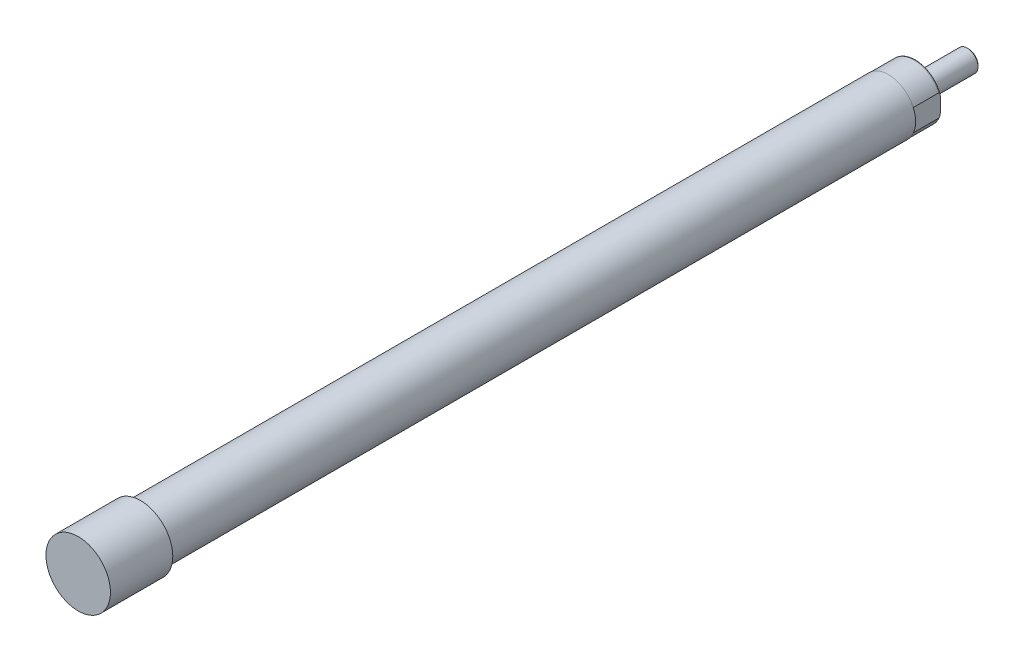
ISO-10303-21;
HEADER;
FILE_DESCRIPTION(('STEP AP214'),'2;1');
FILE_NAME('part.step','',(''),(''),'','','');
FILE_SCHEMA(('AUTOMOTIVE_DESIGN { 1 0 10303 214 1 1 1 1 }'));
ENDSEC;
DATA;
#1=APPLICATION_CONTEXT('core data for automotive mechanical design processes');
#2=APPLICATION_PROTOCOL_DEFINITION('international standard','automotive_design',2000,#1);
#3=PRODUCT_CONTEXT('',#1,'mechanical');
#4=PRODUCT('Part','Part','',(#3));
#5=PRODUCT_RELATED_PRODUCT_CATEGORY('part','',(#4));
#6=PRODUCT_DEFINITION_FORMATION('','',#4);
#7=PRODUCT_DEFINITION_CONTEXT('part definition',#1,'design');
#8=PRODUCT_DEFINITION('design','',#6,#7);
#9=PRODUCT_DEFINITION_SHAPE('','',#8);
#10=(LENGTH_UNIT() NAMED_UNIT(*) SI_UNIT(.MILLI.,.METRE.));
#11=(NAMED_UNIT(*) PLANE_ANGLE_UNIT() SI_UNIT($,.RADIAN.));
#12=(NAMED_UNIT(*) SI_UNIT($,.STERADIAN.) SOLID_ANGLE_UNIT());
#13=UNCERTAINTY_MEASURE_WITH_UNIT(LENGTH_MEASURE(1.E-05),#10,'distance_accuracy_value','');
#14=(GEOMETRIC_REPRESENTATION_CONTEXT(3) GLOBAL_UNCERTAINTY_ASSIGNED_CONTEXT((#13)) GLOBAL_UNIT_ASSIGNED_CONTEXT((#10,
#11,#12)) REPRESENTATION_CONTEXT('',''));
#15=CARTESIAN_POINT('',(0.,0.,0.));
#16=DIRECTION('',(0.,0.,1.));
#17=DIRECTION('',(1.,0.,0.));
#18=AXIS2_PLACEMENT_3D('',#15,#16,#17);
#19=CARTESIAN_POINT('',(0.,0.,389.514986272));
#20=DIRECTION('',(0.,0.,1.));
#21=DIRECTION('',(1.,0.,0.));
#22=AXIS2_PLACEMENT_3D('',#19,#20,#21);
#23=PLANE('',#22);
#24=CARTESIAN_POINT('',(0.,0.,389.514986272));
#25=DIRECTION('',(0.,0.,1.));
#26=DIRECTION('',(1.,0.,0.));
#27=AXIS2_PLACEMENT_3D('',#24,#25,#26);
#28=CIRCLE('',#27,15.);
#29=CARTESIAN_POINT('',(15.,0.,389.514986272));
#30=VERTEX_POINT('',#29);
#31=EDGE_CURVE('E201',#30,#30,#28,.T.);
#32=ORIENTED_EDGE('',*,*,#31,.T.);
#33=EDGE_LOOP('',(#32));
#34=FACE_BOUND('',#33,.T.);
#35=ADVANCED_FACE('F16',(#34),#23,.T.);
#36=CARTESIAN_POINT('',(0.,0.,389.514986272));
#37=DIRECTION('',(0.,0.,-1.));
#38=DIRECTION('',(-1.,0.,0.));
#39=AXIS2_PLACEMENT_3D('',#36,#37,#38);
#40=CYLINDRICAL_SURFACE('',#39,15.);
#41=ORIENTED_EDGE('',*,*,#31,.F.);
#42=EDGE_LOOP('',(#41));
#43=FACE_BOUND('',#42,.T.);
#44=CARTESIAN_POINT('',(0.,0.,360.514486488));
#45=DIRECTION('',(0.,0.,1.));
#46=DIRECTION('',(1.,0.,0.));
#47=AXIS2_PLACEMENT_3D('',#44,#45,#46);
#48=CIRCLE('',#47,15.);
#49=CARTESIAN_POINT('',(15.,0.,360.514486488));
#50=VERTEX_POINT('',#49);
#51=EDGE_CURVE('E199',#50,#50,#48,.T.);
#52=ORIENTED_EDGE('',*,*,#51,.T.);
#53=EDGE_LOOP('',(#52));
#54=FACE_BOUND('',#53,.T.);
#55=ADVANCED_FACE('F176',(#43,#54),#40,.T.);
#56=CARTESIAN_POINT('',(0.,0.,360.514486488));
#57=DIRECTION('',(0.,0.,1.));
#58=DIRECTION('',(1.,0.,0.));
#59=AXIS2_PLACEMENT_3D('',#56,#57,#58);
#60=PLANE('',#59);
#61=CARTESIAN_POINT('',(0.,0.,360.514486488));
#62=DIRECTION('',(0.,0.,1.));
#63=DIRECTION('',(1.,0.,0.));
#64=AXIS2_PLACEMENT_3D('',#61,#62,#63);
#65=CIRCLE('',#64,12.573);
#66=CARTESIAN_POINT('',(12.573,0.,360.514486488));
#67=VERTEX_POINT('',#66);
#68=EDGE_CURVE('E20',#67,#67,#65,.T.);
#69=ORIENTED_EDGE('',*,*,#68,.T.);
#70=EDGE_LOOP('',(#69));
#71=FACE_BOUND('',#70,.T.);
#72=ORIENTED_EDGE('',*,*,#51,.F.);
#73=EDGE_LOOP('',(#72));
#74=FACE_BOUND('',#73,.T.);
#75=ADVANCED_FACE('F183',(#71,#74),#60,.F.);
#76=CARTESIAN_POINT('',(0.,0.,360.210395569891));
#77=DIRECTION('',(0.,0.,1.));
#78=DIRECTION('',(1.,0.,0.));
#79=AXIS2_PLACEMENT_3D('',#76,#77,#78);
#80=CYLINDRICAL_SURFACE('',#79,12.573);
#81=ORIENTED_EDGE('',*,*,#68,.F.);
#82=EDGE_LOOP('',(#81));
#83=FACE_BOUND('',#82,.T.);
#84=CARTESIAN_POINT('',(0.,0.,360.00698636));
#85=DIRECTION('',(0.,0.,1.));
#86=DIRECTION('',(0.,-1.,0.));
#87=AXIS2_PLACEMENT_3D('',#84,#85,#86);
#88=CIRCLE('',#87,12.573);
#89=CARTESIAN_POINT('',(0.,-12.573,360.00698636));
#90=VERTEX_POINT('',#89);
#91=EDGE_CURVE('E208',#90,#90,#88,.F.);
#92=ORIENTED_EDGE('',*,*,#91,.F.);
#93=EDGE_LOOP('',(#92));
#94=FACE_BOUND('',#93,.T.);
#95=ADVANCED_FACE('F18',(#83,#94),#80,.T.);
#96=CARTESIAN_POINT('',(0.,0.,360.00698636));
#97=DIRECTION('',(0.,0.,1.));
#98=DIRECTION('',(-1.,0.,0.));
#99=AXIS2_PLACEMENT_3D('',#96,#97,#98);
#100=PLANE('',#99);
#101=ORIENTED_EDGE('',*,*,#91,.T.);
#102=EDGE_LOOP('',(#101));
#103=FACE_BOUND('',#102,.T.);
#104=CARTESIAN_POINT('',(0.,0.,360.00698636));
#105=DIRECTION('',(0.,0.,1.));
#106=DIRECTION('',(-1.,0.,0.));
#107=AXIS2_PLACEMENT_3D('',#104,#105,#106);
#108=CIRCLE('',#107,12.69238);
#109=CARTESIAN_POINT('',(-12.69238,0.,360.00698636));
#110=VERTEX_POINT('',#109);
#111=EDGE_CURVE('E207',#110,#110,#108,.T.);
#112=ORIENTED_EDGE('',*,*,#111,.T.);
#113=EDGE_LOOP('',(#112));
#114=FACE_BOUND('',#113,.T.);
#115=ADVANCED_FACE('F161',(#103,#114),#100,.T.);
#116=CARTESIAN_POINT('',(0.,0.,334.60698636));
#117=DIRECTION('',(0.,0.,1.));
#118=DIRECTION('',(-1.,0.,0.));
#119=AXIS2_PLACEMENT_3D('',#116,#117,#118);
#120=CYLINDRICAL_SURFACE('',#119,12.69238);
#121=ORIENTED_EDGE('',*,*,#111,.F.);
#122=EDGE_LOOP('',(#121));
#123=FACE_BOUND('',#122,.T.);
#124=CARTESIAN_POINT('',(0.,0.,12.7));
#125=DIRECTION('',(0.,0.,1.));
#126=DIRECTION('',(0.,1.,0.));
#127=AXIS2_PLACEMENT_3D('',#124,#125,#126);
#128=CIRCLE('',#127,12.69238);
#129=CARTESIAN_POINT('',(0.,12.69238,12.7));
#130=VERTEX_POINT('',#129);
#131=EDGE_CURVE('E204',#130,#130,#128,.T.);
#132=ORIENTED_EDGE('',*,*,#131,.T.);
#133=EDGE_LOOP('',(#132));
#134=FACE_BOUND('',#133,.T.);
#135=ADVANCED_FACE('F159',(#123,#134),#120,.T.);
#136=CARTESIAN_POINT('',(0.,0.,12.7));
#137=DIRECTION('',(0.,0.,-1.));
#138=DIRECTION('',(0.,-1.,0.));
#139=AXIS2_PLACEMENT_3D('',#136,#137,#138);
#140=PLANE('',#139);
#141=ORIENTED_EDGE('',*,*,#131,.F.);
#142=EDGE_LOOP('',(#141));
#143=FACE_BOUND('',#142,.T.);
#144=CARTESIAN_POINT('',(0.,0.,12.7));
#145=DIRECTION('',(0.,0.,-1.));
#146=DIRECTION('',(0.,-1.,0.));
#147=AXIS2_PLACEMENT_3D('',#144,#145,#146);
#148=CIRCLE('',#147,12.573);
#149=CARTESIAN_POINT('',(11.4935,-5.09703705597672,12.7));
#150=VERTEX_POINT('',#149);
#151=CARTESIAN_POINT('',(-11.4935,-5.09703705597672,12.7));
#152=VERTEX_POINT('',#151);
#153=EDGE_CURVE('E87',#150,#152,#148,.T.);
#154=ORIENTED_EDGE('',*,*,#153,.F.);
#155=DIRECTION('',(0.,1.,0.));
#156=VECTOR('',#155,1.);
#157=CARTESIAN_POINT('',(11.4935,5.09703705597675,12.7));
#158=LINE('',#157,#156);
#159=CARTESIAN_POINT('',(11.4935,5.09703705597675,12.7));
#160=VERTEX_POINT('',#159);
#161=EDGE_CURVE('E83',#150,#160,#158,.T.);
#162=ORIENTED_EDGE('',*,*,#161,.T.);
#163=CARTESIAN_POINT('',(-11.4935,5.09703705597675,12.7));
#164=VERTEX_POINT('',#163);
#165=EDGE_CURVE('E81',#164,#160,#148,.T.);
#166=ORIENTED_EDGE('',*,*,#165,.F.);
#167=DIRECTION('',(0.,-1.,0.));
#168=VECTOR('',#167,1.);
#169=CARTESIAN_POINT('',(-11.4935,5.09703705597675,12.7));
#170=LINE('',#169,#168);
#171=EDGE_CURVE('E72',#164,#152,#170,.T.);
#172=ORIENTED_EDGE('',*,*,#171,.T.);
#173=EDGE_LOOP('',(#154,#162,#166,#172));
#174=FACE_BOUND('',#173,.T.);
#175=ADVANCED_FACE('F82',(#143,#174),#140,.T.);
#176=CARTESIAN_POINT('',(0.,5.,-24.638));
#177=DIRECTION('',(0.,0.,1.));
#178=DIRECTION('',(0.,1.,0.));
#179=AXIS2_PLACEMENT_3D('',#176,#177,#178);
#180=PLANE('',#179);
#181=CARTESIAN_POINT('',(0.,0.,-24.638));
#182=DIRECTION('',(0.,0.,1.));
#183=DIRECTION('',(0.,1.,0.));
#184=AXIS2_PLACEMENT_3D('',#181,#182,#183);
#185=CIRCLE('',#184,4.365);
#186=CARTESIAN_POINT('',(0.,4.36500000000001,-24.638));
#187=VERTEX_POINT('',#186);
#188=EDGE_CURVE('E25',#187,#187,#185,.F.);
#189=ORIENTED_EDGE('',*,*,#188,.T.);
#190=EDGE_LOOP('',(#189));
#191=FACE_BOUND('',#190,.T.);
#192=ADVANCED_FACE('F137',(#191),#180,.F.);
#193=CARTESIAN_POINT('',(0.,0.,-24.638));
#194=DIRECTION('',(0.,0.,1.));
#195=DIRECTION('',(0.,1.,0.));
#196=AXIS2_PLACEMENT_3D('',#193,#194,#195);
#197=CONICAL_SURFACE('',#196,4.365,0.785398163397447);
#198=CARTESIAN_POINT('',(0.,0.,-24.003));
#199=DIRECTION('',(0.,0.,1.));
#200=DIRECTION('',(0.,1.,0.));
#201=AXIS2_PLACEMENT_3D('',#198,#199,#200);
#202=CIRCLE('',#201,5.);
#203=CARTESIAN_POINT('',(0.,5.00000000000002,-24.003));
#204=VERTEX_POINT('',#203);
#205=EDGE_CURVE('E10',#204,#204,#202,.T.);
#206=ORIENTED_EDGE('',*,*,#205,.F.);
#207=EDGE_LOOP('',(#206));
#208=FACE_BOUND('',#207,.T.);
#209=ORIENTED_EDGE('',*,*,#188,.F.);
#210=EDGE_LOOP('',(#209));
#211=FACE_BOUND('',#210,.T.);
#212=ADVANCED_FACE('F140',(#208,#211),#197,.T.);
#213=CARTESIAN_POINT('',(0.,0.,-4.72421244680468));
#214=DIRECTION('',(0.,0.,-1.));
#215=DIRECTION('',(0.,-1.,0.));
#216=AXIS2_PLACEMENT_3D('',#213,#214,#215);
#217=CYLINDRICAL_SURFACE('',#216,5.);
#218=ORIENTED_EDGE('',*,*,#205,.T.);
#219=EDGE_LOOP('',(#218));
#220=FACE_BOUND('',#219,.T.);
#221=CARTESIAN_POINT('',(0.,0.,0.));
#222=DIRECTION('',(0.,0.,-1.));
#223=DIRECTION('',(0.,-1.,0.));
#224=AXIS2_PLACEMENT_3D('',#221,#222,#223);
#225=CIRCLE('',#224,5.);
#226=CARTESIAN_POINT('',(0.,-4.99999999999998,0.));
#227=VERTEX_POINT('',#226);
#228=EDGE_CURVE('E88',#227,#227,#225,.T.);
#229=ORIENTED_EDGE('',*,*,#228,.T.);
#230=EDGE_LOOP('',(#229));
#231=FACE_BOUND('',#230,.T.);
#232=ADVANCED_FACE('F142',(#220,#231),#217,.T.);
#233=CARTESIAN_POINT('',(0.,5.,0.));
#234=DIRECTION('',(0.,0.,1.));
#235=DIRECTION('',(0.,1.,0.));
#236=AXIS2_PLACEMENT_3D('',#233,#234,#235);
#237=PLANE('',#236);
#238=CARTESIAN_POINT('',(0.,0.,0.));
#239=DIRECTION('',(0.,0.,1.));
#240=DIRECTION('',(0.,1.,0.));
#241=AXIS2_PLACEMENT_3D('',#238,#239,#240);
#242=CIRCLE('',#241,11.811);
#243=CARTESIAN_POINT('',(11.4935,-2.72014314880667,0.));
#244=VERTEX_POINT('',#243);
#245=CARTESIAN_POINT('',(-11.4935,-2.72014314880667,0.));
#246=VERTEX_POINT('',#245);
#247=EDGE_CURVE('E109',#244,#246,#242,.F.);
#248=ORIENTED_EDGE('',*,*,#247,.T.);
#249=DIRECTION('',(0.,-1.,0.));
#250=VECTOR('',#249,1.);
#251=CARTESIAN_POINT('',(-11.4935,5.09703705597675,0.));
#252=LINE('',#251,#250);
#253=CARTESIAN_POINT('',(-11.4935,2.7201431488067,0.));
#254=VERTEX_POINT('',#253);
#255=EDGE_CURVE('E78',#254,#246,#252,.T.);
#256=ORIENTED_EDGE('',*,*,#255,.F.);
#257=CARTESIAN_POINT('',(11.4935,2.7201431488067,0.));
#258=VERTEX_POINT('',#257);
#259=EDGE_CURVE('E108',#254,#258,#242,.F.);
#260=ORIENTED_EDGE('',*,*,#259,.T.);
#261=DIRECTION('',(0.,1.,0.));
#262=VECTOR('',#261,1.);
#263=CARTESIAN_POINT('',(11.4935,5.09703705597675,0.));
#264=LINE('',#263,#262);
#265=EDGE_CURVE('E95',#244,#258,#264,.T.);
#266=ORIENTED_EDGE('',*,*,#265,.F.);
#267=EDGE_LOOP('',(#248,#256,#260,#266));
#268=FACE_BOUND('',#267,.T.);
#269=ORIENTED_EDGE('',*,*,#228,.F.);
#270=EDGE_LOOP('',(#269));
#271=FACE_BOUND('',#270,.T.);
#272=ADVANCED_FACE('F145',(#268,#271),#237,.F.);
#273=CARTESIAN_POINT('',(0.,0.,0.762000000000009));
#274=DIRECTION('',(0.,0.,1.));
#275=DIRECTION('',(0.,1.,0.));
#276=AXIS2_PLACEMENT_3D('',#273,#274,#275);
#277=TOROIDAL_SURFACE('',#276,11.811,0.762);
#278=CARTESIAN_POINT('',(-11.4935,0.,0.0692967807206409));
#279=CARTESIAN_POINT('',(-11.4935,-0.126892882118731,0.0692961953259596));
#280=CARTESIAN_POINT('',(-11.4935,-0.253785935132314,0.0683214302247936));
#281=CARTESIAN_POINT('',(-11.4935,-0.507552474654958,0.0645639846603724));
#282=CARTESIAN_POINT('',(-11.4935,-0.634425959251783,0.0617811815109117));
#283=CARTESIAN_POINT('',(-11.4935,-0.888441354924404,0.0548077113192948));
#284=CARTESIAN_POINT('',(-11.4935,-1.01558316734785,0.0506136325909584));
#285=CARTESIAN_POINT('',(-11.4935,-1.26981683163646,0.0414520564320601));
#286=CARTESIAN_POINT('',(-11.4935,-1.39690868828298,0.0364846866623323));
#287=CARTESIAN_POINT('',(-11.4935,-1.72923810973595,0.023508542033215));
#288=CARTESIAN_POINT('',(-11.4935,-1.93447479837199,0.0155077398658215));
#289=CARTESIAN_POINT('',(-11.4935,-2.3452927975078,0.00350629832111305));
#290=CARTESIAN_POINT('',(-11.4935,-2.55087425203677,-0.00049075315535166));
#291=CARTESIAN_POINT('',(-11.4935,-2.85891684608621,0.000314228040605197));
#292=CARTESIAN_POINT('',(-11.4935,-2.96137763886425,0.00170827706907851));
#293=CARTESIAN_POINT('',(-11.4935,-3.16620727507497,0.00754578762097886));
#294=CARTESIAN_POINT('',(-11.4935,-3.26857612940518,0.0119888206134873));
#295=CARTESIAN_POINT('',(-11.4935,-3.47289957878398,0.0248727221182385));
#296=CARTESIAN_POINT('',(-11.4935,-3.57485458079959,0.0333068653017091));
#297=CARTESIAN_POINT('',(-11.4935,-3.77818054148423,0.0554156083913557));
#298=CARTESIAN_POINT('',(-11.4935,-3.87955178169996,0.0690874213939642));
#299=CARTESIAN_POINT('',(-11.4935,-4.03106259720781,0.0949374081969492));
#300=CARTESIAN_POINT('',(-11.4935,-4.08165102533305,0.104487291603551));
#301=CARTESIAN_POINT('',(-11.4935,-4.1824059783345,0.125703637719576));
#302=CARTESIAN_POINT('',(-11.4935,-4.23257236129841,0.13737078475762));
#303=CARTESIAN_POINT('',(-11.4935,-4.33209838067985,0.16318270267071));
#304=CARTESIAN_POINT('',(-11.4935,-4.38146010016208,0.177319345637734));
#305=CARTESIAN_POINT('',(-11.4935,-4.47919900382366,0.20862800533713));
#306=CARTESIAN_POINT('',(-11.4935,-4.52757673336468,0.225798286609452));
#307=CARTESIAN_POINT('',(-11.4935,-4.61806962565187,0.262016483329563));
#308=CARTESIAN_POINT('',(-11.4935,-4.6603269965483,0.280704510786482));
#309=CARTESIAN_POINT('',(-11.4935,-4.74313491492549,0.322012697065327));
#310=CARTESIAN_POINT('',(-11.4935,-4.78367806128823,0.344648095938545));
#311=CARTESIAN_POINT('',(-11.4935,-4.86229215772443,0.395289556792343));
#312=CARTESIAN_POINT('',(-11.4935,-4.90031004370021,0.423379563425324));
#313=CARTESIAN_POINT('',(-11.4935,-4.97037880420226,0.486182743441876));
#314=CARTESIAN_POINT('',(-11.4935,-5.00247662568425,0.520838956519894));
#315=CARTESIAN_POINT('',(-11.4935,-5.04022262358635,0.575713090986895));
#316=CARTESIAN_POINT('',(-11.4935,-5.05045795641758,0.592752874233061));
#317=CARTESIAN_POINT('',(-11.4935,-5.06829844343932,0.628176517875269));
#318=CARTESIAN_POINT('',(-11.4935,-5.07590504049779,0.64655963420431));
#319=CARTESIAN_POINT('',(-11.4935,-5.08790591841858,0.684572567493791));
#320=CARTESIAN_POINT('',(-11.4935,-5.09226768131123,0.7042129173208));
#321=CARTESIAN_POINT('',(-11.4935,-5.09715001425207,0.74396476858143));
#322=CARTESIAN_POINT('',(-11.4935,-5.09767385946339,0.764075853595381));
#323=CARTESIAN_POINT('',(-11.4935,-5.09497722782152,0.801901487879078));
#324=CARTESIAN_POINT('',(-11.4935,-5.09214509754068,0.819645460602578));
#325=CARTESIAN_POINT('',(-11.4935,-5.08364214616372,0.854435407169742));
#326=CARTESIAN_POINT('',(-11.4935,-5.07796944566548,0.871480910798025));
#327=CARTESIAN_POINT('',(-11.4935,-5.06176012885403,0.910500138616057));
#328=CARTESIAN_POINT('',(-11.4935,-5.05020880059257,0.932049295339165));
#329=CARTESIAN_POINT('',(-11.4935,-5.02384264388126,0.97304162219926));
#330=CARTESIAN_POINT('',(-11.4935,-5.00902025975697,0.99247975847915));
#331=CARTESIAN_POINT('',(-11.4935,-4.96668214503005,1.04130236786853));
#332=CARTESIAN_POINT('',(-11.4935,-4.93717655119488,1.06894318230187));
#333=CARTESIAN_POINT('',(-11.4935,-4.87453292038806,1.11969282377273));
#334=CARTESIAN_POINT('',(-11.4935,-4.84138518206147,1.14278906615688));
#335=CARTESIAN_POINT('',(-11.4935,-4.77170357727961,1.18607022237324));
#336=CARTESIAN_POINT('',(-11.4935,-4.73509294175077,1.20612961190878));
#337=CARTESIAN_POINT('',(-11.4935,-4.66032044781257,1.24315357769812));
#338=CARTESIAN_POINT('',(-11.4935,-4.62215694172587,1.26011475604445));
#339=CARTESIAN_POINT('',(-11.4935,-4.54474065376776,1.29152031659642));
#340=CARTESIAN_POINT('',(-11.4935,-4.50548604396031,1.3059601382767));
#341=CARTESIAN_POINT('',(-11.4935,-4.42628718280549,1.33270242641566));
#342=CARTESIAN_POINT('',(-11.4935,-4.38634329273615,1.34500597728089));
#343=CARTESIAN_POINT('',(-11.4935,-4.27858567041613,1.37558139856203));
#344=CARTESIAN_POINT('',(-11.4935,-4.2103079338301,1.39221547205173));
#345=CARTESIAN_POINT('',(-11.4935,-4.07289691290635,1.42153442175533));
#346=CARTESIAN_POINT('',(-11.4935,-4.00376315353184,1.43421699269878));
#347=CARTESIAN_POINT('',(-11.4935,-3.86485977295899,1.45641961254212));
#348=CARTESIAN_POINT('',(-11.4935,-3.79508917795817,1.46593347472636));
#349=CARTESIAN_POINT('',(-11.4935,-3.65523676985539,1.48234652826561));
#350=CARTESIAN_POINT('',(-11.4935,-3.58515490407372,1.48924525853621));
#351=CARTESIAN_POINT('',(-11.4935,-3.37385236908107,1.50678626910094));
#352=CARTESIAN_POINT('',(-11.4935,-3.23236218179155,1.51415909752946));
#353=CARTESIAN_POINT('',(-11.4935,-2.94941281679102,1.52296953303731));
#354=CARTESIAN_POINT('',(-11.4935,-2.80795379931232,1.52441412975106));
#355=CARTESIAN_POINT('',(-11.4935,-2.50036989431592,1.52329989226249));
#356=CARTESIAN_POINT('',(-11.4935,-2.33424995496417,1.51999816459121));
#357=CARTESIAN_POINT('',(-11.4935,-2.00208204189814,1.5106123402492));
#358=CARTESIAN_POINT('',(-11.4935,-1.83603408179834,1.50452784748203));
#359=CARTESIAN_POINT('',(-11.4935,-1.50389171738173,1.49176055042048));
#360=CARTESIAN_POINT('',(-11.4935,-1.33779732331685,1.48507749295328));
#361=CARTESIAN_POINT('',(-11.4935,-1.0055718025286,1.47295909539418));
#362=CARTESIAN_POINT('',(-11.4935,-0.839440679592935,1.46752365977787));
#363=CARTESIAN_POINT('',(-11.4935,-0.507781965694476,1.45929152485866));
#364=CARTESIAN_POINT('',(-11.4935,-0.342254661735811,1.4564842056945));
#365=CARTESIAN_POINT('',(-11.4935,-0.0111754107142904,1.45416428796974));
#366=CARTESIAN_POINT('',(-11.4935,0.154376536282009,1.45465168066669));
#367=CARTESIAN_POINT('',(-11.4935,0.485437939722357,1.45880069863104));
#368=CARTESIAN_POINT('',(-11.4935,0.650947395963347,1.46246233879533));
#369=CARTESIAN_POINT('',(-11.4935,0.981900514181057,1.4720536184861));
#370=CARTESIAN_POINT('',(-11.4935,1.14734417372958,1.47798333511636));
#371=CARTESIAN_POINT('',(-11.4935,1.47852523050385,1.49061349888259));
#372=CARTESIAN_POINT('',(-11.4935,1.64426256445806,1.49731544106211));
#373=CARTESIAN_POINT('',(-11.4935,1.9758076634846,1.50954880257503));
#374=CARTESIAN_POINT('',(-11.4935,2.14161543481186,1.51508007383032));
#375=CARTESIAN_POINT('',(-11.4935,2.47341239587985,1.52268768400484));
#376=CARTESIAN_POINT('',(-11.4935,2.63940163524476,1.52476213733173));
#377=CARTESIAN_POINT('',(-11.4935,2.97133248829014,1.52271711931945));
#378=CARTESIAN_POINT('',(-11.4935,3.1372740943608,1.51860013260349));
#379=CARTESIAN_POINT('',(-11.4935,3.38613550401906,1.50500966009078));
#380=CARTESIAN_POINT('',(-11.4935,3.46925125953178,1.49922413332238));
#381=CARTESIAN_POINT('',(-11.4935,3.63523838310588,1.48452631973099));
#382=CARTESIAN_POINT('',(-11.4935,3.7181096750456,1.47561314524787));
#383=CARTESIAN_POINT('',(-11.4935,3.8834005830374,1.45385768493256));
#384=CARTESIAN_POINT('',(-11.4935,3.96581991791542,1.44101318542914));
#385=CARTESIAN_POINT('',(-11.4935,4.12967782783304,1.41030415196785));
#386=CARTESIAN_POINT('',(-11.4935,4.21111702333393,1.39244298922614));
#387=CARTESIAN_POINT('',(-11.4935,4.37277499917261,1.34998542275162));
#388=CARTESIAN_POINT('',(-11.4935,4.45298529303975,1.32535467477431));
#389=CARTESIAN_POINT('',(-11.4935,4.57055485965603,1.28144845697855));
#390=CARTESIAN_POINT('',(-11.4935,4.60922233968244,1.2656863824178));
#391=CARTESIAN_POINT('',(-11.4935,4.68526518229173,1.23132879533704));
#392=CARTESIAN_POINT('',(-11.4935,4.72264164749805,1.21273577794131));
#393=CARTESIAN_POINT('',(-11.4935,4.78740678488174,1.17653326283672));
#394=CARTESIAN_POINT('',(-11.4935,4.81517799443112,1.15961369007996));
#395=CARTESIAN_POINT('',(-11.4935,4.8690685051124,1.12317332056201));
#396=CARTESIAN_POINT('',(-11.4935,4.89518458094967,1.10364766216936));
#397=CARTESIAN_POINT('',(-11.4935,4.9451367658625,1.06126433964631));
#398=CARTESIAN_POINT('',(-11.4935,4.96894270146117,1.03837044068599));
#399=CARTESIAN_POINT('',(-11.4935,5.01237357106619,0.988902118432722));
#400=CARTESIAN_POINT('',(-11.4935,5.03201460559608,0.962342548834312));
#401=CARTESIAN_POINT('',(-11.4935,5.05799898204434,0.917209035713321));
#402=CARTESIAN_POINT('',(-11.4935,5.06648257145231,0.899874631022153));
#403=CARTESIAN_POINT('',(-11.4935,5.08061154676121,0.864078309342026));
#404=CARTESIAN_POINT('',(-11.4935,5.08625993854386,0.845617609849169));
#405=CARTESIAN_POINT('',(-11.4935,5.09422278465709,0.807821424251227));
#406=CARTESIAN_POINT('',(-11.4935,5.09651080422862,0.788480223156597));
#407=CARTESIAN_POINT('',(-11.4935,5.0974002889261,0.749712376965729));
#408=CARTESIAN_POINT('',(-11.4935,5.09600235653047,0.730285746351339));
#409=CARTESIAN_POINT('',(-11.4935,5.08998844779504,0.693828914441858));
#410=CARTESIAN_POINT('',(-11.4935,5.08568671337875,0.676744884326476));
#411=CARTESIAN_POINT('',(-11.4935,5.07456544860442,0.643425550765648));
#412=CARTESIAN_POINT('',(-11.4935,5.06774459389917,0.627190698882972));
#413=CARTESIAN_POINT('',(-11.4935,5.04798792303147,0.587684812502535));
#414=CARTESIAN_POINT('',(-11.4935,5.03371113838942,0.56508721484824));
#415=CARTESIAN_POINT('',(-11.4935,5.00181780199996,0.522390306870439));
#416=CARTESIAN_POINT('',(-11.4935,4.98419202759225,0.502298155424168));
#417=CARTESIAN_POINT('',(-11.4935,4.9329313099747,0.450539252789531));
#418=CARTESIAN_POINT('',(-11.4935,4.89701592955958,0.42115474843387));
#419=CARTESIAN_POINT('',(-11.4935,4.82146615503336,0.367730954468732));
#420=CARTESIAN_POINT('',(-11.4935,4.78182217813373,0.343706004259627));
#421=CARTESIAN_POINT('',(-11.4935,4.68702319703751,0.292631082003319));
#422=CARTESIAN_POINT('',(-11.4935,4.63103054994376,0.267155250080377));
#423=CARTESIAN_POINT('',(-11.4935,4.51686717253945,0.221561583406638));
#424=CARTESIAN_POINT('',(-11.4935,4.45869243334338,0.201454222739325));
#425=CARTESIAN_POINT('',(-11.4935,4.34081668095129,0.165335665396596));
#426=CARTESIAN_POINT('',(-11.4935,4.2811099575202,0.149343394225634));
#427=CARTESIAN_POINT('',(-11.4935,4.16097255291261,0.120738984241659));
#428=CARTESIAN_POINT('',(-11.4935,4.10054263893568,0.108123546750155));
#429=CARTESIAN_POINT('',(-11.4935,3.9310044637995,0.0766853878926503));
#430=CARTESIAN_POINT('',(-11.4935,3.82133858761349,0.0608860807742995));
#431=CARTESIAN_POINT('',(-11.4935,3.60125990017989,0.035614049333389));
#432=CARTESIAN_POINT('',(-11.4935,3.49084661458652,0.026145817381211));
#433=CARTESIAN_POINT('',(-11.4935,3.26947072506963,0.0119151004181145));
#434=CARTESIAN_POINT('',(-11.4935,3.15850743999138,0.00716372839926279));
#435=CARTESIAN_POINT('',(-11.4935,2.93647933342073,0.00118653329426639));
#436=CARTESIAN_POINT('',(-11.4935,2.82541449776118,-3.86840557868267E-05));
#437=CARTESIAN_POINT('',(-11.4935,2.4918105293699,8.10114788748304E-05));
#438=CARTESIAN_POINT('',(-11.4935,2.26928570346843,0.00524044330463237));
#439=CARTESIAN_POINT('',(-11.4935,1.82468104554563,0.0194616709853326));
#440=CARTESIAN_POINT('',(-11.4935,1.60260100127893,0.0285187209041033));
#441=CARTESIAN_POINT('',(-11.4935,1.26539134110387,0.0415572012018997));
#442=CARTESIAN_POINT('',(-11.4935,1.15027844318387,0.045881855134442));
#443=CARTESIAN_POINT('',(-11.4935,0.92000000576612,0.0537394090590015));
#444=CARTESIAN_POINT('',(-11.4935,0.804834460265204,0.0572721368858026));
#445=CARTESIAN_POINT('',(-11.4935,0.574734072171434,0.0631011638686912));
#446=CARTESIAN_POINT('',(-11.4935,0.45979930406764,0.0654002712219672));
#447=CARTESIAN_POINT('',(-11.4935,0.229909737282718,0.0684983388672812));
#448=CARTESIAN_POINT('',(-11.4935,0.114954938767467,0.0692973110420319));
#449=CARTESIAN_POINT('',(-11.4935,0.,0.0692967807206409));
#450=B_SPLINE_CURVE_WITH_KNOTS('',3,(#278,#279,#280,#281,#282,#283,#284,#285,#286,#287,#288,
#289,#290,#291,#292,#293,#294,#295,#296,#297,#298,#299,#300,#301,#302,#303,#304,#305,#306,#307,
#308,#309,#310,#311,#312,#313,#314,#315,#316,#317,#318,#319,#320,#321,#322,#323,#324,#325,#326,
#327,#328,#329,#330,#331,#332,#333,#334,#335,#336,#337,#338,#339,#340,#341,#342,#343,#344,#345,
#346,#347,#348,#349,#350,#351,#352,#353,#354,#355,#356,#357,#358,#359,#360,#361,#362,#363,#364,
#365,#366,#367,#368,#369,#370,#371,#372,#373,#374,#375,#376,#377,#378,#379,#380,#381,#382,#383,
#384,#385,#386,#387,#388,#389,#390,#391,#392,#393,#394,#395,#396,#397,#398,#399,#400,#401,#402,
#403,#404,#405,#406,#407,#408,#409,#410,#411,#412,#413,#414,#415,#416,#417,#418,#419,#420,#421,
#422,#423,#424,#425,#426,#427,#428,#429,#430,#431,#432,#433,#434,#435,#436,#437,#438,#439,#440,
#441,#442,#443,#444,#445,#446,#447,#448,#449),.UNSPECIFIED.,.T.,.F.,(4,2,2,2,2,2,2,2,2,2,2,2,2,
2,2,2,2,2,2,2,2,2,2,2,2,2,2,2,2,2,2,2,2,2,2,2,2,2,2,2,2,2,2,2,2,2,2,2,2,2,2,2,2,2,2,2,2,2,2,2,2,
2,2,2,2,2,2,2,2,2,2,2,2,2,2,2,2,2,2,2,2,2,2,2,2,4),(0.,0.380675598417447,0.761377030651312,
1.14300548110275,1.5245709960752,2.14075619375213,2.75749308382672,3.06487070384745,
3.37220513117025,3.67902351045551,3.98567886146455,4.14008965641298,4.29455044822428,
4.44851212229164,4.60238600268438,4.74086028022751,4.87988152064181,5.02124151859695,
5.16142717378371,5.22088517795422,5.28031049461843,5.34032360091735,5.40028548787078,
5.45393540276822,5.50762086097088,5.58055703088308,5.65366346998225,5.77427079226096,
5.89520753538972,6.0202518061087,6.14543240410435,6.27083712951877,6.39617801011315,
6.60683320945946,6.81761107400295,7.02879808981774,7.24002232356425,7.66485310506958,
8.08918284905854,8.58758698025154,9.08606207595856,9.58474901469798,10.0833977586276,
10.5800227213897,11.0766463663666,11.5732723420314,12.0699152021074,12.5675362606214,
13.0652202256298,13.563175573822,14.0609311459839,14.3108363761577,14.5608125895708,
14.8109298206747,15.0608793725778,15.3121211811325,15.4373083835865,15.5623858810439,
15.6598354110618,15.7574693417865,15.856242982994,15.9546275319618,16.0123273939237,
16.0699659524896,16.1280555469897,16.1861356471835,16.2387663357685,16.2914247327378,
16.3711541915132,16.4511064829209,16.5895345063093,16.7283285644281,16.9124465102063,
17.0969210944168,17.2822295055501,17.467356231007,17.7994571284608,18.1317934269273,
18.4649108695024,18.7980855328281,19.4657059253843,20.1325156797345,20.4780956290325,
20.8237506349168,21.1686154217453,21.5134774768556),.UNSPECIFIED.);
#451=CARTESIAN_POINT('',(-11.4935,5.09703705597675,0.762000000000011));
#452=VERTEX_POINT('',#451);
#453=EDGE_CURVE('E121',#452,#254,#450,.T.);
#454=ORIENTED_EDGE('',*,*,#453,.F.);
#455=CARTESIAN_POINT('',(0.,0.,0.762000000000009));
#456=DIRECTION('',(0.,0.,1.));
#457=DIRECTION('',(0.,1.,0.));
#458=AXIS2_PLACEMENT_3D('',#455,#456,#457);
#459=CIRCLE('',#458,12.573);
#460=CARTESIAN_POINT('',(11.4935,5.09703705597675,0.761999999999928));
#461=VERTEX_POINT('',#460);
#462=EDGE_CURVE('E93',#461,#452,#459,.T.);
#463=ORIENTED_EDGE('',*,*,#462,.F.);
#464=CARTESIAN_POINT('',(11.4935,0.,0.0692967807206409));
#465=CARTESIAN_POINT('',(11.4935,0.126892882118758,0.0692961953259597));
#466=CARTESIAN_POINT('',(11.4935,0.253785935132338,0.0683214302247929));
#467=CARTESIAN_POINT('',(11.4935,0.507552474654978,0.0645639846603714));
#468=CARTESIAN_POINT('',(11.4935,0.634425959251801,0.0617811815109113));
#469=CARTESIAN_POINT('',(11.4935,0.888441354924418,0.0548077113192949));
#470=CARTESIAN_POINT('',(11.4935,1.01558316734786,0.0506136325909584));
#471=CARTESIAN_POINT('',(11.4935,1.26981683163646,0.0414520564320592));
#472=CARTESIAN_POINT('',(11.4935,1.39690868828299,0.0364846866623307));
#473=CARTESIAN_POINT('',(11.4935,1.72923810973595,0.0235085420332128));
#474=CARTESIAN_POINT('',(11.4935,1.93447479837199,0.0155077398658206));
#475=CARTESIAN_POINT('',(11.4935,2.34529279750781,0.00350629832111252));
#476=CARTESIAN_POINT('',(11.4935,2.55087425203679,-0.00049075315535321));
#477=CARTESIAN_POINT('',(11.4935,2.85891684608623,0.000314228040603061));
#478=CARTESIAN_POINT('',(11.4935,2.96137763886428,0.00170827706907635));
#479=CARTESIAN_POINT('',(11.4935,3.166207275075,0.00754578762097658));
#480=CARTESIAN_POINT('',(11.4935,3.26857612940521,0.0119888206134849));
#481=CARTESIAN_POINT('',(11.4935,3.47289957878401,0.0248727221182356));
#482=CARTESIAN_POINT('',(11.4935,3.57485458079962,0.0333068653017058));
#483=CARTESIAN_POINT('',(11.4935,3.77818054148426,0.055415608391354));
#484=CARTESIAN_POINT('',(11.4935,3.8795517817,0.0690874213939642));
#485=CARTESIAN_POINT('',(11.4935,4.03106259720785,0.0949374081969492));
#486=CARTESIAN_POINT('',(11.4935,4.08165102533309,0.10448729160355));
#487=CARTESIAN_POINT('',(11.4935,4.18240597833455,0.125703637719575));
#488=CARTESIAN_POINT('',(11.4935,4.23257236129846,0.137370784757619));
#489=CARTESIAN_POINT('',(11.4935,4.33209838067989,0.16318270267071));
#490=CARTESIAN_POINT('',(11.4935,4.38146010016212,0.177319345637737));
#491=CARTESIAN_POINT('',(11.4935,4.47919900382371,0.208628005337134));
#492=CARTESIAN_POINT('',(11.4935,4.52757673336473,0.225798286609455));
#493=CARTESIAN_POINT('',(11.4935,4.61806962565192,0.262016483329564));
#494=CARTESIAN_POINT('',(11.4935,4.66032699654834,0.280704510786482));
#495=CARTESIAN_POINT('',(11.4935,4.74313491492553,0.322012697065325));
#496=CARTESIAN_POINT('',(11.4935,4.78367806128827,0.344648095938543));
#497=CARTESIAN_POINT('',(11.4935,4.86229215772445,0.395289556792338));
#498=CARTESIAN_POINT('',(11.4935,4.90031004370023,0.423379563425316));
#499=CARTESIAN_POINT('',(11.4935,4.97037880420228,0.486182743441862));
#500=CARTESIAN_POINT('',(11.4935,5.00247662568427,0.520838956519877));
#501=CARTESIAN_POINT('',(11.4935,5.04022262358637,0.575713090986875));
#502=CARTESIAN_POINT('',(11.4935,5.05045795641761,0.592752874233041));
#503=CARTESIAN_POINT('',(11.4935,5.06829844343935,0.62817651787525));
#504=CARTESIAN_POINT('',(11.4935,5.07590504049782,0.646559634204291));
#505=CARTESIAN_POINT('',(11.4935,5.08790591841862,0.684572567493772));
#506=CARTESIAN_POINT('',(11.4935,5.09226768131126,0.704212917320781));
#507=CARTESIAN_POINT('',(11.4935,5.09715001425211,0.743964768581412));
#508=CARTESIAN_POINT('',(11.4935,5.09767385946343,0.764075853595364));
#509=CARTESIAN_POINT('',(11.4935,5.09497722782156,0.801901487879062));
#510=CARTESIAN_POINT('',(11.4935,5.09214509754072,0.819645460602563));
#511=CARTESIAN_POINT('',(11.4935,5.08364214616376,0.854435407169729));
#512=CARTESIAN_POINT('',(11.4935,5.07796944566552,0.871480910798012));
#513=CARTESIAN_POINT('',(11.4935,5.06176012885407,0.910500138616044));
#514=CARTESIAN_POINT('',(11.4935,5.05020880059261,0.932049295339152));
#515=CARTESIAN_POINT('',(11.4935,5.0238426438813,0.973041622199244));
#516=CARTESIAN_POINT('',(11.4935,5.00902025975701,0.992479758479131));
#517=CARTESIAN_POINT('',(11.4935,4.96668214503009,1.04130236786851));
#518=CARTESIAN_POINT('',(11.4935,4.93717655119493,1.06894318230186));
#519=CARTESIAN_POINT('',(11.4935,4.87453292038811,1.11969282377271));
#520=CARTESIAN_POINT('',(11.4935,4.84138518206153,1.14278906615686));
#521=CARTESIAN_POINT('',(11.4935,4.77170357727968,1.18607022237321));
#522=CARTESIAN_POINT('',(11.4935,4.73509294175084,1.20612961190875));
#523=CARTESIAN_POINT('',(11.4935,4.66032044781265,1.24315357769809));
#524=CARTESIAN_POINT('',(11.4935,4.62215694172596,1.26011475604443));
#525=CARTESIAN_POINT('',(11.4935,4.54474065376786,1.29152031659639));
#526=CARTESIAN_POINT('',(11.4935,4.50548604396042,1.30596013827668));
#527=CARTESIAN_POINT('',(11.4935,4.4262871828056,1.33270242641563));
#528=CARTESIAN_POINT('',(11.4935,4.38634329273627,1.34500597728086));
#529=CARTESIAN_POINT('',(11.4935,4.27858567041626,1.375581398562));
#530=CARTESIAN_POINT('',(11.4935,4.21030793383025,1.3922154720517));
#531=CARTESIAN_POINT('',(11.4935,4.07289691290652,1.4215344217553));
#532=CARTESIAN_POINT('',(11.4935,4.00376315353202,1.43421699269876));
#533=CARTESIAN_POINT('',(11.4935,3.8648597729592,1.4564196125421));
#534=CARTESIAN_POINT('',(11.4935,3.79508917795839,1.46593347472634));
#535=CARTESIAN_POINT('',(11.4935,3.65523676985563,1.48234652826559));
#536=CARTESIAN_POINT('',(11.4935,3.58515490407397,1.48924525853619));
#537=CARTESIAN_POINT('',(11.4935,3.37385236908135,1.50678626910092));
#538=CARTESIAN_POINT('',(11.4935,3.23236218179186,1.51415909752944));
#539=CARTESIAN_POINT('',(11.4935,2.94941281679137,1.5229695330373));
#540=CARTESIAN_POINT('',(11.4935,2.8079537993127,1.52441412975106));
#541=CARTESIAN_POINT('',(11.4935,2.50036989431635,1.5232998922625));
#542=CARTESIAN_POINT('',(11.4935,2.33424995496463,1.51999816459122));
#543=CARTESIAN_POINT('',(11.4935,2.00208204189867,1.51061234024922));
#544=CARTESIAN_POINT('',(11.4935,1.8360340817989,1.50452784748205));
#545=CARTESIAN_POINT('',(11.4935,1.50389171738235,1.4917605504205));
#546=CARTESIAN_POINT('',(11.4935,1.33779732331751,1.4850774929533));
#547=CARTESIAN_POINT('',(11.4935,1.00557180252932,1.4729590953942));
#548=CARTESIAN_POINT('',(11.4935,0.839440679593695,1.46752365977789));
#549=CARTESIAN_POINT('',(11.4935,0.507781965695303,1.45929152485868));
#550=CARTESIAN_POINT('',(11.4935,0.342254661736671,1.45648420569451));
#551=CARTESIAN_POINT('',(11.4935,0.0111754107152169,1.45416428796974));
#552=CARTESIAN_POINT('',(11.4935,-0.15437653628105,1.45465168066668));
#553=CARTESIAN_POINT('',(11.4935,-0.485437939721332,1.45880069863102));
#554=CARTESIAN_POINT('',(11.4935,-0.650947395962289,1.4624623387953));
#555=CARTESIAN_POINT('',(11.4935,-0.981900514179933,1.47205361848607));
#556=CARTESIAN_POINT('',(11.4935,-1.14734417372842,1.47798333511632));
#557=CARTESIAN_POINT('',(11.4935,-1.47852523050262,1.49061349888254));
#558=CARTESIAN_POINT('',(11.4935,-1.6442625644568,1.49731544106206));
#559=CARTESIAN_POINT('',(11.4935,-1.97580766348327,1.50954880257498));
#560=CARTESIAN_POINT('',(11.4935,-2.14161543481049,1.51508007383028));
#561=CARTESIAN_POINT('',(11.4935,-2.47341239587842,1.52268768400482));
#562=CARTESIAN_POINT('',(11.4935,-2.6394016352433,1.52476213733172));
#563=CARTESIAN_POINT('',(11.4935,-2.97133248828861,1.52271711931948));
#564=CARTESIAN_POINT('',(11.4935,-3.13727409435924,1.51860013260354));
#565=CARTESIAN_POINT('',(11.4935,-3.38613550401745,1.50500966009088));
#566=CARTESIAN_POINT('',(11.4935,-3.46925125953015,1.4992241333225));
#567=CARTESIAN_POINT('',(11.4935,-3.63523838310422,1.48452631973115));
#568=CARTESIAN_POINT('',(11.4935,-3.71810967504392,1.47561314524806));
#569=CARTESIAN_POINT('',(11.4935,-3.8834005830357,1.45385768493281));
#570=CARTESIAN_POINT('',(11.4935,-3.9658199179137,1.44101318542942));
#571=CARTESIAN_POINT('',(11.4935,-4.1296778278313,1.41030415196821));
#572=CARTESIAN_POINT('',(11.4935,-4.21111702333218,1.39244298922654));
#573=CARTESIAN_POINT('',(11.4935,-4.37277499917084,1.34998542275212));
#574=CARTESIAN_POINT('',(11.4935,-4.45298529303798,1.32535467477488));
#575=CARTESIAN_POINT('',(11.4935,-4.57055485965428,1.28144845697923));
#576=CARTESIAN_POINT('',(11.4935,-4.60922233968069,1.26568638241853));
#577=CARTESIAN_POINT('',(11.4935,-4.68526518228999,1.23132879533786));
#578=CARTESIAN_POINT('',(11.4935,-4.72264164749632,1.21273577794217));
#579=CARTESIAN_POINT('',(11.4935,-4.78740678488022,1.1765332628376));
#580=CARTESIAN_POINT('',(11.4935,-4.81517799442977,1.15961369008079));
#581=CARTESIAN_POINT('',(11.4935,-4.86906850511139,1.12317332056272));
#582=CARTESIAN_POINT('',(11.4935,-4.89518458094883,1.10364766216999));
#583=CARTESIAN_POINT('',(11.4935,-4.94513676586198,1.06126433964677));
#584=CARTESIAN_POINT('',(11.4935,-4.96894270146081,1.03837044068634));
#585=CARTESIAN_POINT('',(11.4935,-5.01237357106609,0.988902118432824));
#586=CARTESIAN_POINT('',(11.4935,-5.03201460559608,0.962342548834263));
#587=CARTESIAN_POINT('',(11.4935,-5.05799898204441,0.917209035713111));
#588=CARTESIAN_POINT('',(11.4935,-5.06648257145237,0.89987463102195));
#589=CARTESIAN_POINT('',(11.4935,-5.08061154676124,0.86407830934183));
#590=CARTESIAN_POINT('',(11.4935,-5.08625993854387,0.845617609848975));
#591=CARTESIAN_POINT('',(11.4935,-5.09422278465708,0.807821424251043));
#592=CARTESIAN_POINT('',(11.4935,-5.0965108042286,0.788480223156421));
#593=CARTESIAN_POINT('',(11.4935,-5.09740028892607,0.749712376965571));
#594=CARTESIAN_POINT('',(11.4935,-5.09600235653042,0.730285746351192));
#595=CARTESIAN_POINT('',(11.4935,-5.08998844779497,0.69382891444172));
#596=CARTESIAN_POINT('',(11.4935,-5.08568671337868,0.676744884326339));
#597=CARTESIAN_POINT('',(11.4935,-5.07456544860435,0.643425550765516));
#598=CARTESIAN_POINT('',(11.4935,-5.06774459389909,0.627190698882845));
#599=CARTESIAN_POINT('',(11.4935,-5.04798792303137,0.587684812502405));
#600=CARTESIAN_POINT('',(11.4935,-5.0337111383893,0.565087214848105));
#601=CARTESIAN_POINT('',(11.4935,-5.00181780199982,0.522390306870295));
#602=CARTESIAN_POINT('',(11.4935,-4.98419202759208,0.502298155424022));
#603=CARTESIAN_POINT('',(11.4935,-4.93293130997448,0.450539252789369));
#604=CARTESIAN_POINT('',(11.4935,-4.89701592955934,0.421154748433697));
#605=CARTESIAN_POINT('',(11.4935,-4.82146615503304,0.367730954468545));
#606=CARTESIAN_POINT('',(11.4935,-4.78182217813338,0.343706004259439));
#607=CARTESIAN_POINT('',(11.4935,-4.68702319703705,0.292631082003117));
#608=CARTESIAN_POINT('',(11.4935,-4.63103054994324,0.267155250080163));
#609=CARTESIAN_POINT('',(11.4935,-4.51686717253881,0.221561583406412));
#610=CARTESIAN_POINT('',(11.4935,-4.45869243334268,0.201454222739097));
#611=CARTESIAN_POINT('',(11.4935,-4.34081668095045,0.165335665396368));
#612=CARTESIAN_POINT('',(11.4935,-4.28110995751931,0.149343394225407));
#613=CARTESIAN_POINT('',(11.4935,-4.16097255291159,0.120738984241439));
#614=CARTESIAN_POINT('',(11.4935,-4.1005426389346,0.108123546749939));
#615=CARTESIAN_POINT('',(11.4935,-3.93100446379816,0.0766853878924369));
#616=CARTESIAN_POINT('',(11.4935,-3.82133858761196,0.0608860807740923));
#617=CARTESIAN_POINT('',(11.4935,-3.60125990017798,0.0356140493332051));
#618=CARTESIAN_POINT('',(11.4935,-3.49084661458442,0.0261458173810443));
#619=CARTESIAN_POINT('',(11.4935,-3.26947072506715,0.0119151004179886));
#620=CARTESIAN_POINT('',(11.4935,-3.15850743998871,0.00716372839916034));
#621=CARTESIAN_POINT('',(11.4935,-2.93647933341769,0.00118653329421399));
#622=CARTESIAN_POINT('',(11.4935,-2.82541449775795,-3.86840558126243E-05));
#623=CARTESIAN_POINT('',(11.4935,-2.49181052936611,8.1011478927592E-05));
#624=CARTESIAN_POINT('',(11.4935,-2.26928570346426,0.00524044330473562));
#625=CARTESIAN_POINT('',(11.4935,-1.8246810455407,0.0194616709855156));
#626=CARTESIAN_POINT('',(11.4935,-1.60260100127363,0.0285187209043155));
#627=CARTESIAN_POINT('',(11.4935,-1.26539134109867,0.0415572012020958));
#628=CARTESIAN_POINT('',(11.4935,-1.15027844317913,0.045881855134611));
#629=CARTESIAN_POINT('',(11.4935,-0.92000000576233,0.0537394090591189));
#630=CARTESIAN_POINT('',(11.4935,-0.804834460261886,0.0572721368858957));
#631=CARTESIAN_POINT('',(11.4935,-0.574734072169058,0.0631011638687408));
#632=CARTESIAN_POINT('',(11.4935,-0.459799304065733,0.0654002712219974));
#633=CARTESIAN_POINT('',(11.4935,-0.229909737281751,0.0684983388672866));
#634=CARTESIAN_POINT('',(11.4935,-0.114954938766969,0.0692973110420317));
#635=CARTESIAN_POINT('',(11.4935,0.,0.0692967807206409));
#636=B_SPLINE_CURVE_WITH_KNOTS('',3,(#464,#465,#466,#467,#468,#469,#470,#471,#472,#473,#474,
#475,#476,#477,#478,#479,#480,#481,#482,#483,#484,#485,#486,#487,#488,#489,#490,#491,#492,#493,
#494,#495,#496,#497,#498,#499,#500,#501,#502,#503,#504,#505,#506,#507,#508,#509,#510,#511,#512,
#513,#514,#515,#516,#517,#518,#519,#520,#521,#522,#523,#524,#525,#526,#527,#528,#529,#530,#531,
#532,#533,#534,#535,#536,#537,#538,#539,#540,#541,#542,#543,#544,#545,#546,#547,#548,#549,#550,
#551,#552,#553,#554,#555,#556,#557,#558,#559,#560,#561,#562,#563,#564,#565,#566,#567,#568,#569,
#570,#571,#572,#573,#574,#575,#576,#577,#578,#579,#580,#581,#582,#583,#584,#585,#586,#587,#588,
#589,#590,#591,#592,#593,#594,#595,#596,#597,#598,#599,#600,#601,#602,#603,#604,#605,#606,#607,
#608,#609,#610,#611,#612,#613,#614,#615,#616,#617,#618,#619,#620,#621,#622,#623,#624,#625,#626,
#627,#628,#629,#630,#631,#632,#633,#634,#635),.UNSPECIFIED.,.T.,.F.,(4,2,2,2,2,2,2,2,2,2,2,2,2,
2,2,2,2,2,2,2,2,2,2,2,2,2,2,2,2,2,2,2,2,2,2,2,2,2,2,2,2,2,2,2,2,2,2,2,2,2,2,2,2,2,2,2,2,2,2,2,2,
2,2,2,2,2,2,2,2,2,2,2,2,2,2,2,2,2,2,2,2,2,2,2,2,4),(0.,0.380675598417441,0.761377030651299,
1.14300548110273,1.52457099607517,2.14075619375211,2.75749308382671,3.06487070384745,
3.37220513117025,3.67902351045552,3.98567886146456,4.140089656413,4.2945504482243,
4.44851212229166,4.6023860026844,4.74086028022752,4.87988152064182,5.02124151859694,
5.1614271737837,5.22088517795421,5.28031049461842,5.34032360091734,5.40028548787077,
5.45393540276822,5.50762086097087,5.58055703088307,5.65366346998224,5.77427079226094,
5.89520753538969,6.02025180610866,6.1454324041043,6.2708371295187,6.39617801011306,
6.60683320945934,6.8176110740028,7.02879808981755,7.24002232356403,7.66485310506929,
8.08918284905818,8.58758698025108,9.086062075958,9.58474901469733,10.0833977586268,
10.5800227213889,11.0766463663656,11.5732723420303,12.0699152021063,12.5675362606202,
13.0652202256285,13.5631755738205,14.0609311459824,14.3108363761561,14.5608125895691,
14.810929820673,15.0608793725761,15.3121211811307,15.4373083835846,15.5623858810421,
15.6598354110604,15.7574693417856,15.8562429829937,15.954627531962,16.0123273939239,
16.0699659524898,16.1280555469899,16.1861356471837,16.2387663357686,16.291424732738,
16.3711541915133,16.4511064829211,16.5895345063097,16.7283285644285,16.9124465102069,
17.0969210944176,17.2822295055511,17.4673562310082,17.7994571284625,18.1317934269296,
18.4649108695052,18.7980855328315,19.4657059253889,20.1325156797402,20.4780956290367,
20.8237506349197,21.1686154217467,21.5134774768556),.UNSPECIFIED.);
#637=EDGE_CURVE('E120',#258,#461,#636,.T.);
#638=ORIENTED_EDGE('',*,*,#637,.F.);
#639=ORIENTED_EDGE('',*,*,#259,.F.);
#640=EDGE_LOOP('',(#454,#463,#638,#639));
#641=FACE_BOUND('',#640,.T.);
#642=ADVANCED_FACE('F127',(#641),#277,.T.);
#643=CARTESIAN_POINT('',(0.,0.,-4.72421244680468));
#644=DIRECTION('',(0.,0.,-1.));
#645=DIRECTION('',(0.,-1.,0.));
#646=AXIS2_PLACEMENT_3D('',#643,#644,#645);
#647=CYLINDRICAL_SURFACE('',#646,12.573);
#648=ORIENTED_EDGE('',*,*,#462,.T.);
#649=DIRECTION('',(0.,0.,-1.));
#650=VECTOR('',#649,1.);
#651=CARTESIAN_POINT('',(-11.4935,5.09703705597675,12.7));
#652=LINE('',#651,#650);
#653=EDGE_CURVE('E33',#164,#452,#652,.T.);
#654=ORIENTED_EDGE('',*,*,#653,.F.);
#655=ORIENTED_EDGE('',*,*,#165,.T.);
#656=DIRECTION('',(0.,0.,-1.));
#657=VECTOR('',#656,1.);
#658=CARTESIAN_POINT('',(11.4935,5.09703705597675,12.7));
#659=LINE('',#658,#657);
#660=EDGE_CURVE('E103',#160,#461,#659,.T.);
#661=ORIENTED_EDGE('',*,*,#660,.T.);
#662=EDGE_LOOP('',(#648,#654,#655,#661));
#663=FACE_BOUND('',#662,.T.);
#664=ADVANCED_FACE('F91',(#663),#647,.T.);
#665=ORIENTED_EDGE('',*,*,#153,.T.);
#666=DIRECTION('',(0.,0.,-1.));
#667=VECTOR('',#666,1.);
#668=CARTESIAN_POINT('',(-11.4935,-5.09703705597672,12.7));
#669=LINE('',#668,#667);
#670=CARTESIAN_POINT('',(-11.4935,-5.09703705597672,0.761999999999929));
#671=VERTEX_POINT('',#670);
#672=EDGE_CURVE('E75',#152,#671,#669,.T.);
#673=ORIENTED_EDGE('',*,*,#672,.T.);
#674=CARTESIAN_POINT('',(11.4935,-5.09703705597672,0.762));
#675=VERTEX_POINT('',#674);
#676=EDGE_CURVE('E41',#671,#675,#459,.T.);
#677=ORIENTED_EDGE('',*,*,#676,.T.);
#678=DIRECTION('',(0.,0.,-1.));
#679=VECTOR('',#678,1.);
#680=CARTESIAN_POINT('',(11.4935,-5.09703705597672,12.7));
#681=LINE('',#680,#679);
#682=EDGE_CURVE('E100',#150,#675,#681,.T.);
#683=ORIENTED_EDGE('',*,*,#682,.F.);
#684=EDGE_LOOP('',(#665,#673,#677,#683));
#685=FACE_BOUND('',#684,.T.);
#686=ADVANCED_FACE('F150',(#685),#647,.T.);
#687=EDGE_CURVE('E213',#246,#671,#450,.T.);
#688=ORIENTED_EDGE('',*,*,#687,.F.);
#689=ORIENTED_EDGE('',*,*,#247,.F.);
#690=EDGE_CURVE('E113',#675,#244,#636,.T.);
#691=ORIENTED_EDGE('',*,*,#690,.F.);
#692=ORIENTED_EDGE('',*,*,#676,.F.);
#693=EDGE_LOOP('',(#688,#689,#691,#692));
#694=FACE_BOUND('',#693,.T.);
#695=ADVANCED_FACE('F157',(#694),#277,.T.);
#696=CARTESIAN_POINT('',(-11.4935,5.09703705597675,12.7));
#697=DIRECTION('',(1.,0.,0.));
#698=DIRECTION('',(0.,0.,-1.));
#699=AXIS2_PLACEMENT_3D('',#696,#697,#698);
#700=PLANE('',#699);
#701=ORIENTED_EDGE('',*,*,#687,.T.);
#702=ORIENTED_EDGE('',*,*,#672,.F.);
#703=ORIENTED_EDGE('',*,*,#171,.F.);
#704=ORIENTED_EDGE('',*,*,#653,.T.);
#705=ORIENTED_EDGE('',*,*,#453,.T.);
#706=ORIENTED_EDGE('',*,*,#255,.T.);
#707=EDGE_LOOP('',(#701,#702,#703,#704,#705,#706));
#708=FACE_BOUND('',#707,.T.);
#709=ADVANCED_FACE('F74',(#708),#700,.F.);
#710=CARTESIAN_POINT('',(11.4935,5.09703705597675,12.7));
#711=DIRECTION('',(-1.,0.,0.));
#712=DIRECTION('',(0.,0.,1.));
#713=AXIS2_PLACEMENT_3D('',#710,#711,#712);
#714=PLANE('',#713);
#715=ORIENTED_EDGE('',*,*,#637,.T.);
#716=ORIENTED_EDGE('',*,*,#660,.F.);
#717=ORIENTED_EDGE('',*,*,#161,.F.);
#718=ORIENTED_EDGE('',*,*,#682,.T.);
#719=ORIENTED_EDGE('',*,*,#690,.T.);
#720=ORIENTED_EDGE('',*,*,#265,.T.);
#721=EDGE_LOOP('',(#715,#716,#717,#718,#719,#720));
#722=FACE_BOUND('',#721,.T.);
#723=ADVANCED_FACE('F131',(#722),#714,.F.);
#724=CLOSED_SHELL('',(#35,#55,#75,#95,#115,#135,#175,#192,#212,#232,#272,#642,#664,#686,#695,
#709,#723));
#725=MANIFOLD_SOLID_BREP('B1',#724);
#726=ADVANCED_BREP_SHAPE_REPRESENTATION('',(#18,#725),#14);
#727=SHAPE_DEFINITION_REPRESENTATION(#9,#726);
ENDSEC;
END-ISO-10303-21;
